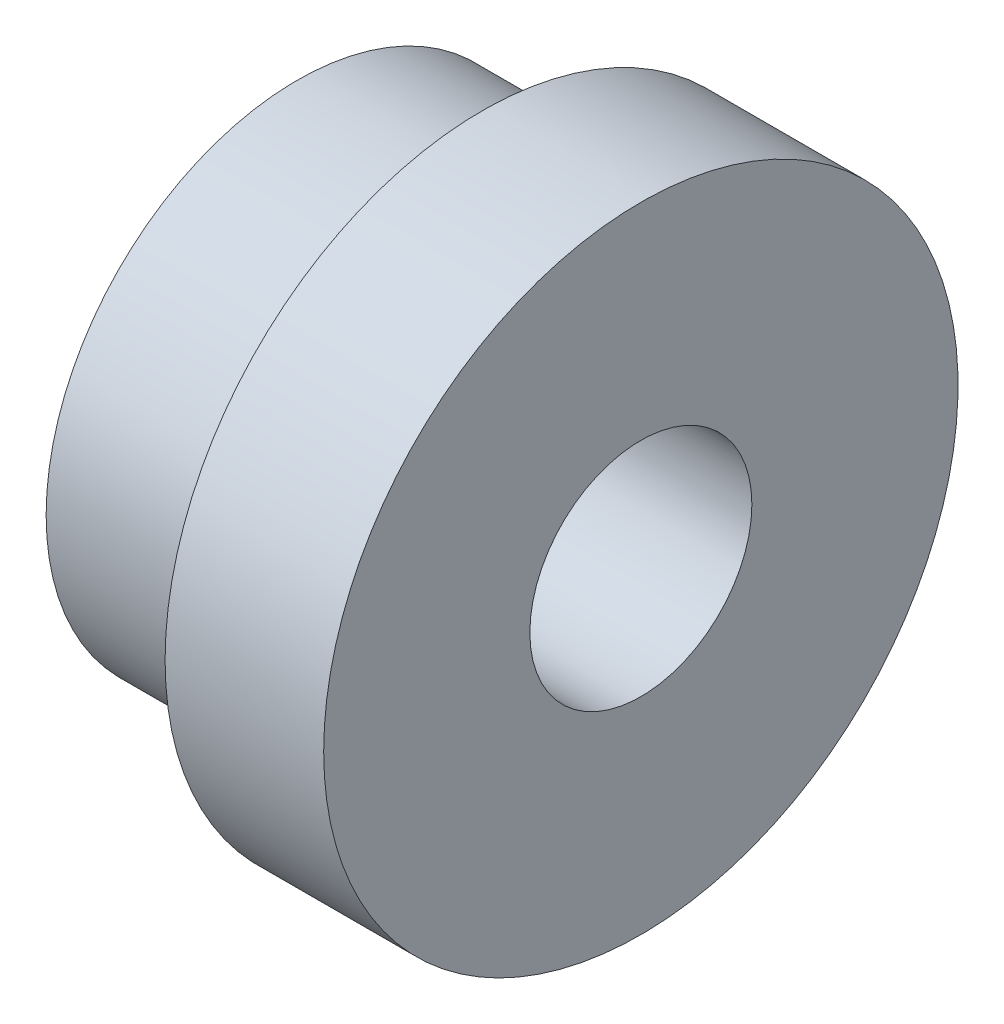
from build123d import *

# Parameters (mm, degrees)
M5_TAPPED_HOLE1_D = 4.2


with BuildPart() as part:
    # Sketch1 → Revolve1 (revolve)
    with BuildSketch(Plane(origin=(0, 0, 0), x_dir=(1, 0, 0), z_dir=(0, 1, 0)), mode=Mode.PRIVATE) as revolve1_sk:
        Polygon((0, 0), (6.5, 0), (6.5, 6), (3.5, 6), (3.5, 4.75), (0, 4.75), align=None)
    revolve(revolve1_sk.sketch.rotate(Axis((0, 0, 0), (1, 0, 0)), 180), axis=Axis((0, 0, 0), (1, 0, 0)))

    # M5 Tapped Hole1 (through all)
    with Locations(Plane(origin=(6.5, 0, 0), x_dir=(0, 0, 1), z_dir=(1, 0, 0))):
        with Locations((0, 0)):
            Hole(M5_TAPPED_HOLE1_D / 2)


solid = part.part
